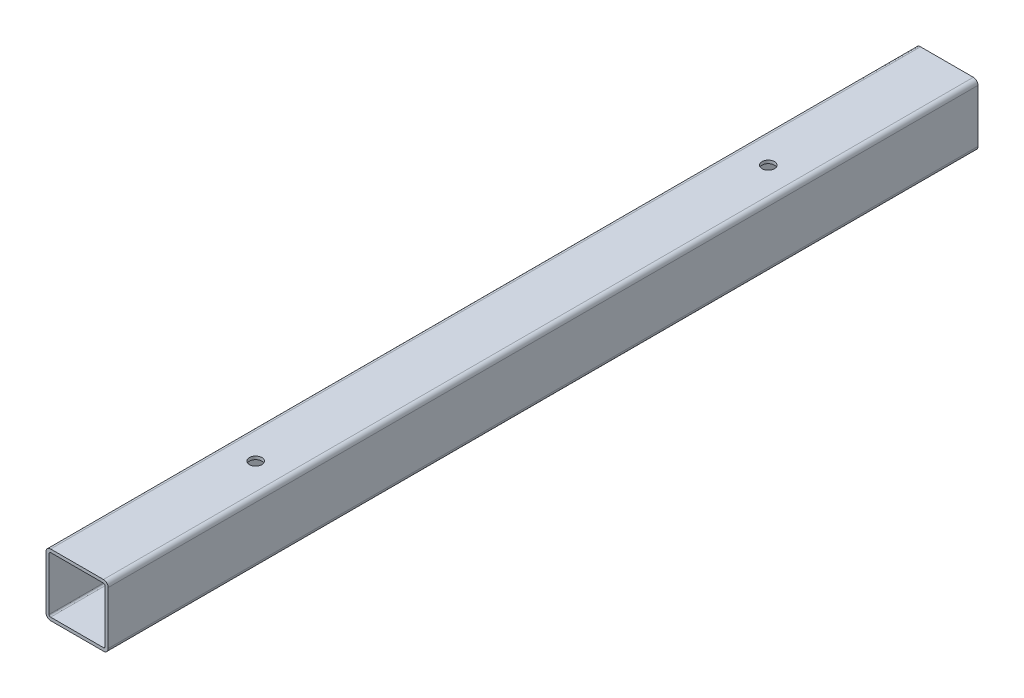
from build123d import *

# Parameters (mm, degrees)
EXTRUSION1_DEPTH        = 560
ESQUISSE2_R             = 4
ENL_V_MAT_EXTRU_1_DEPTH = 563.849891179


with BuildPart() as part:
    # Esquisse1 → Extrusion1 (new body)
    with BuildSketch(Plane.XY):
        with BuildLine():
            Line((3, 0), (37, 0))
            ThreePointArc((37, 0), (39.121320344, 0.878679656), (40, 3))
            Line((40, 3), (40, 37))
            ThreePointArc((40, 37), (39.121320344, 39.121320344), (37, 40))
            Line((37, 40), (3, 40))
            ThreePointArc((3, 40), (0.878679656, 39.121320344), (0, 37))
            Line((0, 37), (0, 3))
            ThreePointArc((0, 3), (0.878679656, 0.878679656), (3, 0))
        make_face()
        with BuildLine():
            Line((3, 2), (37, 2))
            ThreePointArc((37, 2), (37.707106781, 2.292893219), (38, 3))
            Line((38, 3), (38, 37))
            ThreePointArc((38, 37), (37.707106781, 37.707106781), (37, 38))
            Line((37, 38), (3, 38))
            ThreePointArc((3, 38), (2.292893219, 37.707106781), (2, 37))
            Line((2, 37), (2, 3))
            ThreePointArc((2, 3), (2.292893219, 2.292893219), (3, 2))
        make_face(mode=Mode.SUBTRACT)
    extrude(amount=EXTRUSION1_DEPTH)

    # Esquisse2 → Enl_v. mat.-Extru.1 (cut, through all)
    with BuildSketch(Plane(origin=(0, 40, 0), x_dir=(-1, 0, 0), z_dir=(0, 1, 0))):
        with Locations(Location((-20, 115, 0), (0, 0, 90))):
            Circle(ESQUISSE2_R)
        with Locations(Location((-20, 445, 0), (0, 0, 90))):
            Circle(ESQUISSE2_R)
    extrude(amount=-ENL_V_MAT_EXTRU_1_DEPTH, mode=Mode.SUBTRACT)


solid = part.part
